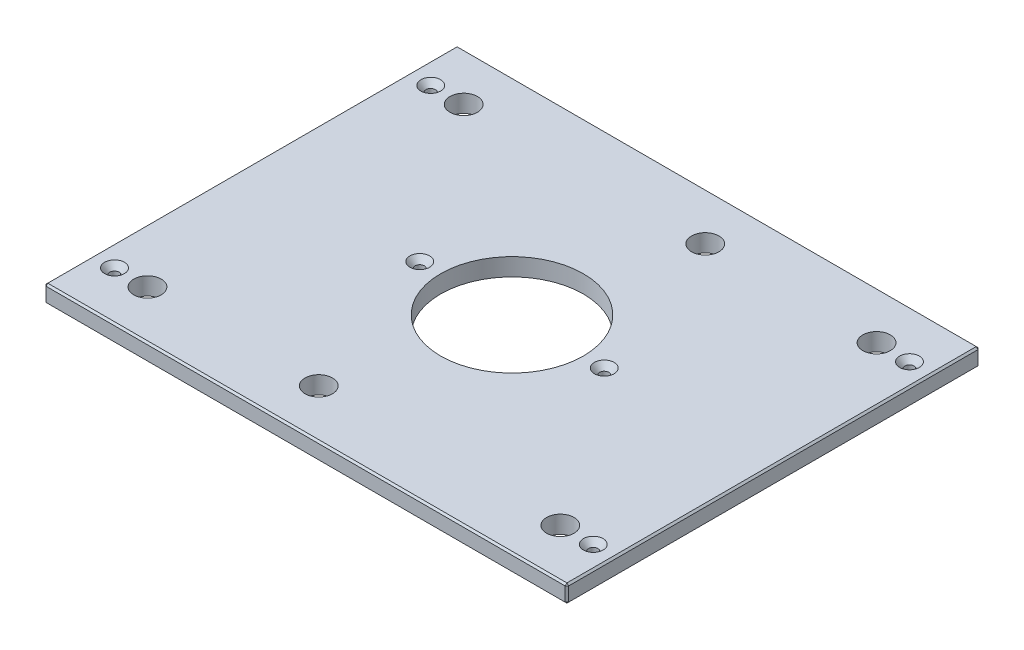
from build123d import *

# Parameters (mm, degrees)
SKETCH1_W                                        = 377.825
SKETCH1_H                                        = 298.45
BOSS_EXTRUDE1_DEPTH                              = 12.7
SKETCH13_R                                       = 51.562
CUT_EXTRUDE6_DEPTH                               = 242.075347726
F_25_32_0_78125_DIAMETER_HOLE1_D                 = 19.84375
CHAMFER2_SIZE                                    = 1.27
CSK_FOR_1_4_FLAT_HEAD_MACHINE_SCREW1_D           = 6.7564
CSK_FOR_1_4_FLAT_HEAD_MACHINE_SCREW1_CSINK_D     = 14.2748
CSK_FOR_1_4_FLAT_HEAD_MACHINE_SCREW1_CSINK_ANGLE = 82


with BuildPart() as part:
    # Sketch1 → Boss-Extrude1 (new body)
    with BuildSketch(Plane(origin=(0, 0, 0), x_dir=(1, 0, 0), z_dir=(0, 1, 0))):
        Rectangle(SKETCH1_W, SKETCH1_H)
    extrude(amount=BOSS_EXTRUDE1_DEPTH)

    # Sketch13 → Cut-Extrude6 (cut, through all)
    with BuildSketch(Plane(origin=(0, 12.7, 0), x_dir=(1, 0, 0), z_dir=(0, 1, 0))):
        with Locations(Location((0, 0, 0), (0, 0, 270))):
            Circle(SKETCH13_R)
    extrude(amount=-CUT_EXTRUDE6_DEPTH, mode=Mode.SUBTRACT)

    # 25_32 _0.78125_ Diameter Hole1 (through all)
    with Locations(Plane(origin=(0, 12.7, 0), x_dir=(1, 0, 0), z_dir=(0, 1, 0))):
        with Locations((149.225, 114.3), (-149.225, 114.3), (149.225, -114.3), (-149.225, -114.3), (25.4, 114.3), (-25.4, -114.3)):
            Hole(F_25_32_0_78125_DIAMETER_HOLE1_D / 2)

    # Chamfer2
    chamfer2_edges = [part.edges().sort_by_distance(p)[0] for p in [
        (188.9125, 12.7, 0),
        (0, 12.7, -149.225),
        (-188.9125, 12.7, 0),
        (0, 0, -149.225),
        (188.9125, 0, 0),
        (0, 0, 149.225),
        (-188.9125, 0, 0),
        (0, 12.7, 149.225),
        (-188.9125, 6.35, -149.225),
        (188.9125, 6.35, -149.225),
        (188.9125, 6.35, 149.225),
        (-188.9125, 6.35, 149.225),
    ]]
    chamfer(chamfer2_edges, length=CHAMFER2_SIZE)

    # CSK for 1_4 Flat Head Machine Screw1 (through all)
    with Locations(Plane(origin=(0, 12.7, 0), x_dir=(1, 0, 0), z_dir=(0, 1, 0))):
        with Locations((173.0375, 114.3), (173.0375, -114.3), (-173.0375, -114.3), (-66.675, 0), (66.675, 0), (-173.0375, 114.3), (-149.225, 114.3), (-149.225, -114.3)):
            CounterSinkHole(CSK_FOR_1_4_FLAT_HEAD_MACHINE_SCREW1_D / 2, CSK_FOR_1_4_FLAT_HEAD_MACHINE_SCREW1_CSINK_D / 2, counter_sink_angle=CSK_FOR_1_4_FLAT_HEAD_MACHINE_SCREW1_CSINK_ANGLE)


solid = part.part
